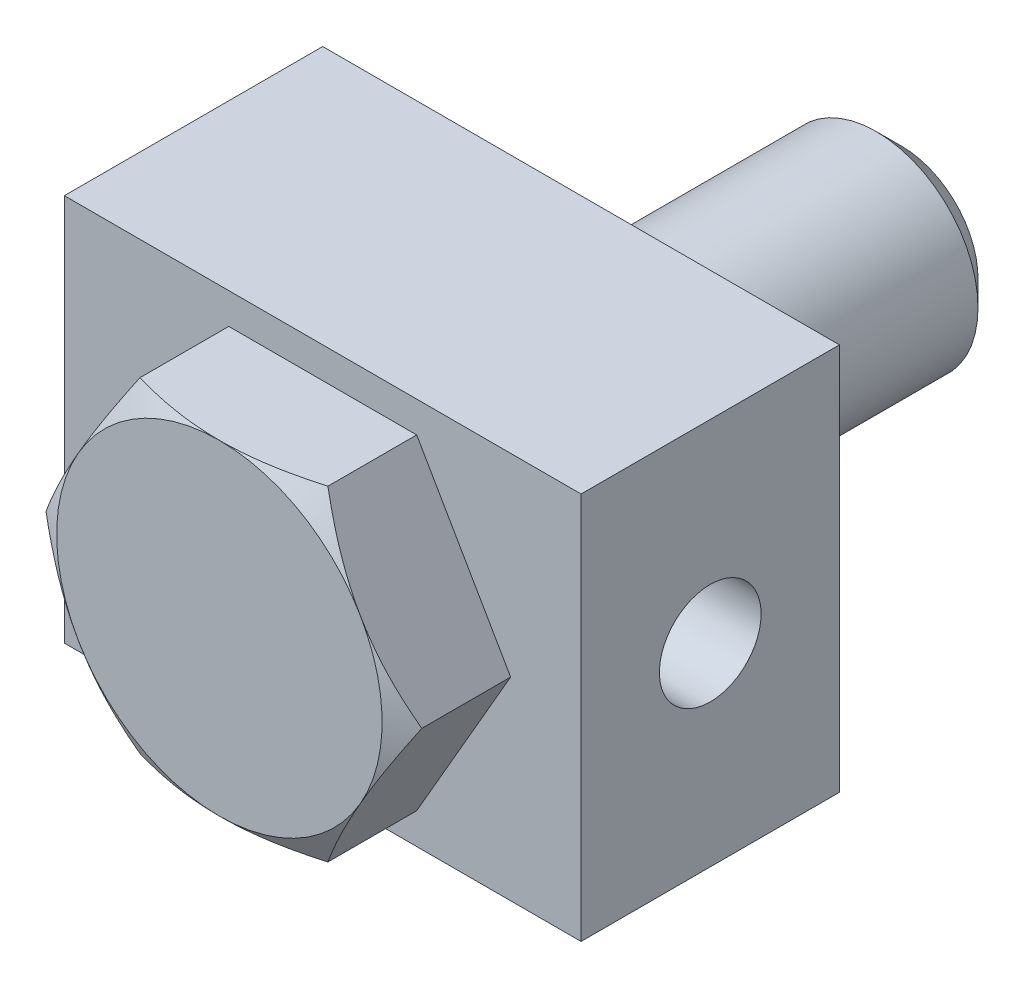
ISO-10303-21;
HEADER;
FILE_DESCRIPTION(('STEP AP214'),'2;1');
FILE_NAME('part.step','',(''),(''),'','','');
FILE_SCHEMA(('AUTOMOTIVE_DESIGN { 1 0 10303 214 1 1 1 1 }'));
ENDSEC;
DATA;
#1=APPLICATION_CONTEXT('core data for automotive mechanical design processes');
#2=APPLICATION_PROTOCOL_DEFINITION('international standard','automotive_design',2000,#1);
#3=PRODUCT_CONTEXT('',#1,'mechanical');
#4=PRODUCT('Part','Part','',(#3));
#5=PRODUCT_RELATED_PRODUCT_CATEGORY('part','',(#4));
#6=PRODUCT_DEFINITION_FORMATION('','',#4);
#7=PRODUCT_DEFINITION_CONTEXT('part definition',#1,'design');
#8=PRODUCT_DEFINITION('design','',#6,#7);
#9=PRODUCT_DEFINITION_SHAPE('','',#8);
#10=(LENGTH_UNIT() NAMED_UNIT(*) SI_UNIT(.MILLI.,.METRE.));
#11=(NAMED_UNIT(*) PLANE_ANGLE_UNIT() SI_UNIT($,.RADIAN.));
#12=(NAMED_UNIT(*) SI_UNIT($,.STERADIAN.) SOLID_ANGLE_UNIT());
#13=UNCERTAINTY_MEASURE_WITH_UNIT(LENGTH_MEASURE(1.E-05),#10,'distance_accuracy_value','');
#14=(GEOMETRIC_REPRESENTATION_CONTEXT(3) GLOBAL_UNCERTAINTY_ASSIGNED_CONTEXT((#13)) GLOBAL_UNIT_ASSIGNED_CONTEXT((#10,
#11,#12)) REPRESENTATION_CONTEXT('',''));
#15=CARTESIAN_POINT('',(0.,0.,0.));
#16=DIRECTION('',(0.,0.,1.));
#17=DIRECTION('',(1.,0.,0.));
#18=AXIS2_PLACEMENT_3D('',#15,#16,#17);
#19=CARTESIAN_POINT('',(9.23760430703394,16.,85.9648074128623));
#20=DIRECTION('',(0.,-1.,0.));
#21=DIRECTION('',(0.,0.,-1.));
#22=AXIS2_PLACEMENT_3D('',#19,#20,#21);
#23=PLANE('',#22);
#24=CARTESIAN_POINT('',(-24.7112843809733,16.,29.3250597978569));
#25=CARTESIAN_POINT('',(-24.3623143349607,16.,29.4941789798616));
#26=CARTESIAN_POINT('',(-24.0129320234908,16.,29.6624470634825));
#27=CARTESIAN_POINT('',(-23.3132567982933,16.,29.9970880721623));
#28=CARTESIAN_POINT('',(-22.9629638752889,16.,30.1634609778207));
#29=CARTESIAN_POINT('',(-21.9104953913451,16.,30.6594919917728));
#30=CARTESIAN_POINT('',(-21.2068349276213,16.,30.9860114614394));
#31=CARTESIAN_POINT('',(-19.7908922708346,16.,31.6304666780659));
#32=CARTESIAN_POINT('',(-19.0785839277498,16.,31.9483451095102));
#33=CARTESIAN_POINT('',(-17.6482667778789,16.,32.5709616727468));
#34=CARTESIAN_POINT('',(-16.9302582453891,16.,32.8757004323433));
#35=CARTESIAN_POINT('',(-15.4645977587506,16.,33.4779257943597));
#36=CARTESIAN_POINT('',(-14.7167256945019,16.,33.7748795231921));
#37=CARTESIAN_POINT('',(-13.2121889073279,16.,34.3460652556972));
#38=CARTESIAN_POINT('',(-12.4555232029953,16.,34.6202946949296));
#39=CARTESIAN_POINT('',(-10.9336699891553,16.,35.1387537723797));
#40=CARTESIAN_POINT('',(-10.1685036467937,16.,35.3830450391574));
#41=CARTESIAN_POINT('',(-8.62712280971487,16.,35.8337346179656));
#42=CARTESIAN_POINT('',(-7.85091191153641,16.,36.0401449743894));
#43=CARTESIAN_POINT('',(-6.68033175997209,16.,36.3132665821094));
#44=CARTESIAN_POINT('',(-6.29015175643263,16.,36.3980454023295));
#45=CARTESIAN_POINT('',(-5.50714502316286,16.,36.5544190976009));
#46=CARTESIAN_POINT('',(-5.11431834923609,16.,36.6260142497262));
#47=CARTESIAN_POINT('',(-4.32630332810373,16.,36.7547495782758));
#48=CARTESIAN_POINT('',(-3.93111505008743,16.,36.811890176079));
#49=CARTESIAN_POINT('',(-3.13878247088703,16.,36.9105762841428));
#50=CARTESIAN_POINT('',(-2.74163817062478,16.,36.9521218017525));
#51=CARTESIAN_POINT('',(-1.95111028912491,16.,37.0182735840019));
#52=CARTESIAN_POINT('',(-1.55774458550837,16.,37.0430921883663));
#53=CARTESIAN_POINT('',(-0.770317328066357,16.,37.0760791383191));
#54=CARTESIAN_POINT('',(-0.376255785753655,16.,37.0842477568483));
#55=CARTESIAN_POINT('',(0.411861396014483,16.,37.0837408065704));
#56=CARTESIAN_POINT('',(0.805917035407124,16.,37.0750651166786));
#57=CARTESIAN_POINT('',(1.59331426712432,16.,37.041079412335));
#58=CARTESIAN_POINT('',(1.98665582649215,16.,37.0157686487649));
#59=CARTESIAN_POINT('',(2.93511162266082,16.,36.9352139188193));
#60=CARTESIAN_POINT('',(3.48955254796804,16.,36.8719032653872));
#61=CARTESIAN_POINT('',(4.59425504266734,16.,36.7157029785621));
#62=CARTESIAN_POINT('',(5.14451602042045,16.,36.6228092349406));
#63=CARTESIAN_POINT('',(6.24035690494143,16.,36.4107475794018));
#64=CARTESIAN_POINT('',(6.78593274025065,16.,36.291558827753));
#65=CARTESIAN_POINT('',(7.87158005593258,16.,36.0305385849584));
#66=CARTESIAN_POINT('',(8.41165162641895,16.,35.8887074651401));
#67=CARTESIAN_POINT('',(9.49806397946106,16.,35.5825243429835));
#68=CARTESIAN_POINT('',(10.0442844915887,16.,35.4177485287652));
#69=CARTESIAN_POINT('',(11.1313437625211,16.,35.0713992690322));
#70=CARTESIAN_POINT('',(11.6721824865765,16.,34.8898257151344));
#71=CARTESIAN_POINT('',(12.7487490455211,16.,34.5127439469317));
#72=CARTESIAN_POINT('',(13.2844785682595,16.,34.3172405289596));
#73=CARTESIAN_POINT('',(14.3515141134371,16.,33.9145766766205));
#74=CARTESIAN_POINT('',(14.8828201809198,16.,33.707416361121));
#75=CARTESIAN_POINT('',(16.1081198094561,16.,33.2166436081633));
#76=CARTESIAN_POINT('',(16.8006919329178,16.,32.9294882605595));
#77=CARTESIAN_POINT('',(18.1801678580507,16.,32.3418336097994));
#78=CARTESIAN_POINT('',(18.8670713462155,16.,32.0413335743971));
#79=CARTESIAN_POINT('',(20.236227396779,16.,31.429582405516));
#80=CARTESIAN_POINT('',(20.9184789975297,16.,31.1183291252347));
#81=CARTESIAN_POINT('',(22.278945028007,16.,30.4871742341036));
#82=CARTESIAN_POINT('',(22.9571595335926,16.,30.1672727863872));
#83=CARTESIAN_POINT('',(24.3108853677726,16.,29.5200659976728));
#84=CARTESIAN_POINT('',(24.9863932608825,16.,29.19275348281));
#85=CARTESIAN_POINT('',(26.3345399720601,16.,28.532273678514));
#86=CARTESIAN_POINT('',(27.0071787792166,16.,28.1991063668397));
#87=CARTESIAN_POINT('',(28.3499383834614,16.,27.5279340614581));
#88=CARTESIAN_POINT('',(29.020059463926,16.,27.1899296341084));
#89=CARTESIAN_POINT('',(30.3582169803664,16.,26.5098169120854));
#90=CARTESIAN_POINT('',(31.0262534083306,16.,26.1677086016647));
#91=CARTESIAN_POINT('',(32.920418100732,16.,25.1914747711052));
#92=CARTESIAN_POINT('',(34.144420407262,16.,24.5532242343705));
#93=CARTESIAN_POINT('',(36.5878340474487,16.,23.2679220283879));
#94=CARTESIAN_POINT('',(37.8072452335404,16.,22.6208700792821));
#95=CARTESIAN_POINT('',(40.2396073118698,16.,21.3215131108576));
#96=CARTESIAN_POINT('',(41.4525666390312,16.,20.6692238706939));
#97=CARTESIAN_POINT('',(43.2698250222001,16.,19.6868354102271));
#98=CARTESIAN_POINT('',(43.8751991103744,16.,19.3587218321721));
#99=CARTESIAN_POINT('',(45.0853008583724,16.,18.7013069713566));
#100=CARTESIAN_POINT('',(45.6900285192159,16.,18.3720056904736));
#101=CARTESIAN_POINT('',(46.2944690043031,16.,18.0421779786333));
#102=B_SPLINE_CURVE_WITH_KNOTS('',3,(#24,#25,#26,#27,#28,#29,#30,#31,#32,#33,#34,#35,#36,#37,
#38,#39,#40,#41,#42,#43,#44,#45,#46,#47,#48,#49,#50,#51,#52,#53,#54,#55,#56,#57,#58,#59,#60,#61,
#62,#63,#64,#65,#66,#67,#68,#69,#70,#71,#72,#73,#74,#75,#76,#77,#78,#79,#80,#81,#82,#83,#84,#85,
#86,#87,#88,#89,#90,#91,#92,#93,#94,#95,#96,#97,#98,#99,#100,#101),.UNSPECIFIED.,.F.,.F.,(4,2,2,
2,2,2,2,2,2,2,2,2,2,2,2,2,2,2,2,2,2,2,2,2,2,2,2,2,2,2,2,2,2,2,2,2,2,2,4),(0.,1.16336904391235,
2.32674998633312,4.65386145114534,6.99381555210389,9.33365772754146,11.7473864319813,
14.1613871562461,16.570332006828,18.9785095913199,20.1761755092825,21.3738162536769,
22.5714220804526,23.7690273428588,24.9511278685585,26.1332090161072,27.3152986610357,
28.4974415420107,30.1706449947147,31.8440810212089,33.5188481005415,35.1935877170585,
36.9048633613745,38.6161500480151,40.3268503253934,42.0375331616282,44.286575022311,
46.5357404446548,48.7853575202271,51.0349321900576,53.286786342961,55.53864905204,
57.7902502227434,60.0418600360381,64.1830509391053,68.3243738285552,72.4560340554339,
74.5217597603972,76.5874822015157),.UNSPECIFIED.);
#103=CARTESIAN_POINT('',(9.23760430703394,16.,35.6549376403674));
#104=VERTEX_POINT('',#103);
#105=CARTESIAN_POINT('',(0.,16.,37.084));
#106=VERTEX_POINT('',#105);
#107=EDGE_CURVE('E109',#104,#106,#102,.F.);
#108=ORIENTED_EDGE('',*,*,#107,.F.);
#109=DIRECTION('',(0.,0.,-1.));
#110=VECTOR('',#109,1.);
#111=CARTESIAN_POINT('',(9.23760430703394,16.,85.9648074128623));
#112=LINE('',#111,#110);
#113=CARTESIAN_POINT('',(9.23760430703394,16.,26.924));
#114=VERTEX_POINT('',#113);
#115=EDGE_CURVE('E208',#104,#114,#112,.T.);
#116=ORIENTED_EDGE('',*,*,#115,.T.);
#117=DIRECTION('',(-1.,0.,0.));
#118=VECTOR('',#117,1.);
#119=CARTESIAN_POINT('',(9.23760430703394,16.,26.924));
#120=LINE('',#119,#118);
#121=CARTESIAN_POINT('',(-9.237604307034,16.,26.924));
#122=VERTEX_POINT('',#121);
#123=EDGE_CURVE('E205',#114,#122,#120,.T.);
#124=ORIENTED_EDGE('',*,*,#123,.T.);
#125=DIRECTION('',(0.,0.,-1.));
#126=VECTOR('',#125,1.);
#127=CARTESIAN_POINT('',(-9.23760430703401,16.,85.9648074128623));
#128=LINE('',#127,#126);
#129=CARTESIAN_POINT('',(-9.23760430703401,16.,35.6549376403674));
#130=VERTEX_POINT('',#129);
#131=EDGE_CURVE('E142',#130,#122,#128,.T.);
#132=ORIENTED_EDGE('',*,*,#131,.F.);
#133=EDGE_CURVE('E121',#106,#130,#102,.F.);
#134=ORIENTED_EDGE('',*,*,#133,.F.);
#135=EDGE_LOOP('',(#108,#116,#124,#132,#134));
#136=FACE_BOUND('',#135,.T.);
#137=ADVANCED_FACE('F14',(#136),#23,.F.);
#138=CARTESIAN_POINT('',(18.475208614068,0.,85.9648074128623));
#139=DIRECTION('',(-0.866025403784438,-0.5,0.));
#140=DIRECTION('',(0.5,-0.866025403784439,0.));
#141=AXIS2_PLACEMENT_3D('',#138,#139,#140);
#142=PLANE('',#141);
#143=CARTESIAN_POINT('',(18.4753240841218,-0.000200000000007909,35.6548709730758));
#144=CARTESIAN_POINT('',(18.2722852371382,0.351473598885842,35.7720876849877));
#145=CARTESIAN_POINT('',(18.0684544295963,0.704518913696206,35.8839853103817));
#146=CARTESIAN_POINT('',(17.6591583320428,1.41344054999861,36.0956638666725));
#147=CARTESIAN_POINT('',(17.4536925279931,1.76931776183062,36.1954408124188));
#148=CARTESIAN_POINT('',(17.0407293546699,2.48459095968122,36.3815367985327));
#149=CARTESIAN_POINT('',(16.8332283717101,2.84399320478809,36.4678239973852));
#150=CARTESIAN_POINT('',(16.416784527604,3.56529510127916,36.62508765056));
#151=CARTESIAN_POINT('',(16.2078417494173,3.92719460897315,36.6960649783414));
#152=CARTESIAN_POINT('',(15.793868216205,4.64421780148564,36.8196899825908));
#153=CARTESIAN_POINT('',(15.588868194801,4.99928825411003,36.8727468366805));
#154=CARTESIAN_POINT('',(15.1779288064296,5.71105615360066,36.9617113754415));
#155=CARTESIAN_POINT('',(14.9719894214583,6.06775363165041,36.9976187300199));
#156=CARTESIAN_POINT('',(14.5597647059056,6.78174778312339,37.0513776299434));
#157=CARTESIAN_POINT('',(14.3534800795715,7.13904323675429,37.0692506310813));
#158=CARTESIAN_POINT('',(13.9407204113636,7.85396395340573,37.0865564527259));
#159=CARTESIAN_POINT('',(13.7342453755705,8.21158920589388,37.0859898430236));
#160=CARTESIAN_POINT('',(13.3482423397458,8.88016607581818,37.0677045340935));
#161=CARTESIAN_POINT('',(13.1686868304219,9.19116534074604,37.0522162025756));
#162=CARTESIAN_POINT('',(12.809988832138,9.81244849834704,37.0075864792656));
#163=CARTESIAN_POINT('',(12.6308463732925,10.1227323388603,36.9784441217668));
#164=CARTESIAN_POINT('',(12.273071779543,10.7424161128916,36.9070144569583));
#165=CARTESIAN_POINT('',(12.0944401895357,11.0518151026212,36.8647162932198));
#166=CARTESIAN_POINT('',(11.7380144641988,11.6691625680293,36.7677171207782));
#167=CARTESIAN_POINT('',(11.5602203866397,11.9771109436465,36.7130152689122));
#168=CARTESIAN_POINT('',(11.0205166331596,12.9119052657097,36.5289213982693));
#169=CARTESIAN_POINT('',(10.6601698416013,13.5360442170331,36.3811733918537));
#170=CARTESIAN_POINT('',(9.94484943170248,14.7750155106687,36.0458459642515));
#171=CARTESIAN_POINT('',(9.58986665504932,15.3898637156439,35.8583452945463));
#172=CARTESIAN_POINT('',(9.2374888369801,16.0002,35.6548709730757));
#173=B_SPLINE_CURVE_WITH_KNOTS('',3,(#143,#144,#145,#146,#147,#148,#149,#150,#151,#152,#153,
#154,#155,#156,#157,#158,#159,#160,#161,#162,#163,#164,#165,#166,#167,#168,#169,#170,#171,#172),
.UNSPECIFIED.,.F.,.F.,(4,2,2,2,2,2,2,2,2,2,2,2,2,2,4),(0.,1.26800386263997,2.53642350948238,
3.80779337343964,5.07909068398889,6.31900943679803,7.55895205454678,8.79741774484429,
10.0358451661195,11.1139198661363,12.1920708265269,13.2711138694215,14.350230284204,
16.5559177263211,18.7572757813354),.UNSPECIFIED.);
#174=CARTESIAN_POINT('',(18.475208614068,0.,35.6549376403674));
#175=VERTEX_POINT('',#174);
#176=CARTESIAN_POINT('',(13.856406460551,8.,37.084));
#177=VERTEX_POINT('',#176);
#178=EDGE_CURVE('E29',#175,#177,#173,.T.);
#179=ORIENTED_EDGE('',*,*,#178,.F.);
#180=DIRECTION('',(0.,0.,-1.));
#181=VECTOR('',#180,1.);
#182=CARTESIAN_POINT('',(18.475208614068,0.,85.9648074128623));
#183=LINE('',#182,#181);
#184=CARTESIAN_POINT('',(18.475208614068,0.,26.924));
#185=VERTEX_POINT('',#184);
#186=EDGE_CURVE('E210',#175,#185,#183,.T.);
#187=ORIENTED_EDGE('',*,*,#186,.T.);
#188=DIRECTION('',(-0.5,0.866025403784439,0.));
#189=VECTOR('',#188,1.);
#190=CARTESIAN_POINT('',(18.475208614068,0.,26.924));
#191=LINE('',#190,#189);
#192=EDGE_CURVE('E202',#185,#114,#191,.T.);
#193=ORIENTED_EDGE('',*,*,#192,.T.);
#194=ORIENTED_EDGE('',*,*,#115,.F.);
#195=EDGE_CURVE('E116',#177,#104,#173,.T.);
#196=ORIENTED_EDGE('',*,*,#195,.F.);
#197=EDGE_LOOP('',(#179,#187,#193,#194,#196));
#198=FACE_BOUND('',#197,.T.);
#199=ADVANCED_FACE('F171',(#198),#142,.F.);
#200=CARTESIAN_POINT('',(9.23760430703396,-16.,85.9648074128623));
#201=DIRECTION('',(-0.866025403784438,0.5,0.));
#202=DIRECTION('',(-0.5,-0.866025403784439,0.));
#203=AXIS2_PLACEMENT_3D('',#200,#201,#202);
#204=PLANE('',#203);
#205=CARTESIAN_POINT('',(9.23748883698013,-16.0002,35.6548709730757));
#206=CARTESIAN_POINT('',(9.44052768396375,-15.6485264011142,35.7720876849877));
#207=CARTESIAN_POINT('',(9.64435849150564,-15.2954810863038,35.8839853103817));
#208=CARTESIAN_POINT('',(10.0536545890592,-14.5865594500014,36.0956638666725));
#209=CARTESIAN_POINT('',(10.2591203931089,-14.2306822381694,36.1954408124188));
#210=CARTESIAN_POINT('',(10.672083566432,-13.5154090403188,36.3815367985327));
#211=CARTESIAN_POINT('',(10.8795845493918,-13.1560067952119,36.4678239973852));
#212=CARTESIAN_POINT('',(11.2960283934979,-12.4347048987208,36.62508765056));
#213=CARTESIAN_POINT('',(11.5049711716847,-12.0728053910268,36.6960649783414));
#214=CARTESIAN_POINT('',(11.9189447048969,-11.3557821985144,36.8196899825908));
#215=CARTESIAN_POINT('',(12.1239447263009,-11.00071174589,36.8727468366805));
#216=CARTESIAN_POINT('',(12.5348841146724,-10.2889438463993,36.9617113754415));
#217=CARTESIAN_POINT('',(12.7408234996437,-9.93224636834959,36.9976187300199));
#218=CARTESIAN_POINT('',(13.1530482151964,-9.21825221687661,37.0513776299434));
#219=CARTESIAN_POINT('',(13.3593328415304,-8.86095676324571,37.0692506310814));
#220=CARTESIAN_POINT('',(13.7720925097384,-8.14603604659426,37.0865564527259));
#221=CARTESIAN_POINT('',(13.9785675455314,-7.78841079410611,37.0859898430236));
#222=CARTESIAN_POINT('',(14.3645705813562,-7.11983392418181,37.0677045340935));
#223=CARTESIAN_POINT('',(14.5441260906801,-6.80883465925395,37.0522162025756));
#224=CARTESIAN_POINT('',(14.902824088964,-6.18755150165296,37.0075864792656));
#225=CARTESIAN_POINT('',(15.0819665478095,-5.87726766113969,36.9784441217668));
#226=CARTESIAN_POINT('',(15.4397411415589,-5.25758388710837,36.9070144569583));
#227=CARTESIAN_POINT('',(15.6183727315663,-4.94818489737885,36.8647162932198));
#228=CARTESIAN_POINT('',(15.9747984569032,-4.33083743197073,36.7677171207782));
#229=CARTESIAN_POINT('',(16.1525925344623,-4.02288905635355,36.7130152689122));
#230=CARTESIAN_POINT('',(16.6922962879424,-3.08809473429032,36.5289213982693));
#231=CARTESIAN_POINT('',(17.0526430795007,-2.46395578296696,36.3811733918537));
#232=CARTESIAN_POINT('',(17.7679634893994,-1.22498448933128,36.0458459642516));
#233=CARTESIAN_POINT('',(18.1229462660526,-0.610136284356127,35.8583452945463));
#234=CARTESIAN_POINT('',(18.4753240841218,0.000199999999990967,35.6548709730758));
#235=B_SPLINE_CURVE_WITH_KNOTS('',3,(#205,#206,#207,#208,#209,#210,#211,#212,#213,#214,#215,
#216,#217,#218,#219,#220,#221,#222,#223,#224,#225,#226,#227,#228,#229,#230,#231,#232,#233,#234),
.UNSPECIFIED.,.F.,.F.,(4,2,2,2,2,2,2,2,2,2,2,2,2,2,4),(0.,1.26800386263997,2.53642350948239,
3.80779337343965,5.0790906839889,6.31900943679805,7.5589520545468,8.79741774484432,
10.0358451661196,11.1139198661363,12.1920708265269,13.2711138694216,14.350230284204,
16.5559177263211,18.7572757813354),.UNSPECIFIED.);
#236=CARTESIAN_POINT('',(9.23760430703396,-16.,35.6549376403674));
#237=VERTEX_POINT('',#236);
#238=CARTESIAN_POINT('',(13.856406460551,-8.,37.084));
#239=VERTEX_POINT('',#238);
#240=EDGE_CURVE('E37',#237,#239,#235,.T.);
#241=ORIENTED_EDGE('',*,*,#240,.F.);
#242=DIRECTION('',(0.,0.,-1.));
#243=VECTOR('',#242,1.);
#244=CARTESIAN_POINT('',(9.23760430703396,-16.,85.9648074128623));
#245=LINE('',#244,#243);
#246=CARTESIAN_POINT('',(9.23760430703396,-16.,26.924));
#247=VERTEX_POINT('',#246);
#248=EDGE_CURVE('E212',#237,#247,#245,.T.);
#249=ORIENTED_EDGE('',*,*,#248,.T.);
#250=DIRECTION('',(0.5,0.866025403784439,0.));
#251=VECTOR('',#250,1.);
#252=CARTESIAN_POINT('',(9.23760430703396,-16.,26.924));
#253=LINE('',#252,#251);
#254=EDGE_CURVE('E199',#247,#185,#253,.T.);
#255=ORIENTED_EDGE('',*,*,#254,.T.);
#256=ORIENTED_EDGE('',*,*,#186,.F.);
#257=EDGE_CURVE('E183',#239,#175,#235,.T.);
#258=ORIENTED_EDGE('',*,*,#257,.F.);
#259=EDGE_LOOP('',(#241,#249,#255,#256,#258));
#260=FACE_BOUND('',#259,.T.);
#261=ADVANCED_FACE('F175',(#260),#204,.F.);
#262=CARTESIAN_POINT('',(-9.23760430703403,-16.,85.9648074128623));
#263=DIRECTION('',(0.,1.,0.));
#264=DIRECTION('',(0.,0.,1.));
#265=AXIS2_PLACEMENT_3D('',#262,#263,#264);
#266=PLANE('',#265);
#267=CARTESIAN_POINT('',(-24.7112843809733,-16.,29.3250597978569));
#268=CARTESIAN_POINT('',(-24.3623143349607,-16.,29.4941789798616));
#269=CARTESIAN_POINT('',(-24.0129320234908,-16.,29.6624470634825));
#270=CARTESIAN_POINT('',(-23.3132567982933,-16.,29.9970880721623));
#271=CARTESIAN_POINT('',(-22.962963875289,-16.,30.1634609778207));
#272=CARTESIAN_POINT('',(-21.9104953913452,-16.,30.6594919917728));
#273=CARTESIAN_POINT('',(-21.2068349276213,-16.,30.9860114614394));
#274=CARTESIAN_POINT('',(-19.7908922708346,-16.,31.6304666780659));
#275=CARTESIAN_POINT('',(-19.0785839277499,-16.,31.9483451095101));
#276=CARTESIAN_POINT('',(-17.648266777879,-16.,32.5709616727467));
#277=CARTESIAN_POINT('',(-16.9302582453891,-16.,32.8757004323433));
#278=CARTESIAN_POINT('',(-15.4645977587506,-16.,33.4779257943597));
#279=CARTESIAN_POINT('',(-14.716725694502,-16.,33.7748795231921));
#280=CARTESIAN_POINT('',(-13.212188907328,-16.,34.3460652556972));
#281=CARTESIAN_POINT('',(-12.4555232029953,-16.,34.6202946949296));
#282=CARTESIAN_POINT('',(-10.9336699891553,-16.,35.1387537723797));
#283=CARTESIAN_POINT('',(-10.1685036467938,-16.,35.3830450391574));
#284=CARTESIAN_POINT('',(-8.6271228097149,-16.,35.8337346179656));
#285=CARTESIAN_POINT('',(-7.85091191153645,-16.,36.0401449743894));
#286=CARTESIAN_POINT('',(-6.68033175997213,-16.,36.3132665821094));
#287=CARTESIAN_POINT('',(-6.29015175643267,-16.,36.3980454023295));
#288=CARTESIAN_POINT('',(-5.5071450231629,-16.,36.5544190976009));
#289=CARTESIAN_POINT('',(-5.11431834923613,-16.,36.6260142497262));
#290=CARTESIAN_POINT('',(-4.32630332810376,-16.,36.7547495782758));
#291=CARTESIAN_POINT('',(-3.93111505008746,-16.,36.811890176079));
#292=CARTESIAN_POINT('',(-3.13878247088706,-16.,36.9105762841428));
#293=CARTESIAN_POINT('',(-2.74163817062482,-16.,36.9521218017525));
#294=CARTESIAN_POINT('',(-1.95111028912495,-16.,37.0182735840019));
#295=CARTESIAN_POINT('',(-1.5577445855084,-16.,37.0430921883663));
#296=CARTESIAN_POINT('',(-0.770317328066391,-16.,37.0760791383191));
#297=CARTESIAN_POINT('',(-0.376255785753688,-16.,37.0842477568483));
#298=CARTESIAN_POINT('',(0.411861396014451,-16.,37.0837408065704));
#299=CARTESIAN_POINT('',(0.805917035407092,-16.,37.0750651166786));
#300=CARTESIAN_POINT('',(1.59331426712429,-16.,37.041079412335));
#301=CARTESIAN_POINT('',(1.98665582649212,-16.,37.0157686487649));
#302=CARTESIAN_POINT('',(2.93511162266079,-16.,36.9352139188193));
#303=CARTESIAN_POINT('',(3.48955254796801,-16.,36.8719032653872));
#304=CARTESIAN_POINT('',(4.59425504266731,-16.,36.7157029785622));
#305=CARTESIAN_POINT('',(5.14451602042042,-16.,36.6228092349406));
#306=CARTESIAN_POINT('',(6.2403569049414,-16.,36.4107475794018));
#307=CARTESIAN_POINT('',(6.78593274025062,-16.,36.291558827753));
#308=CARTESIAN_POINT('',(7.87158005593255,-16.,36.0305385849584));
#309=CARTESIAN_POINT('',(8.41165162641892,-16.,35.8887074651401));
#310=CARTESIAN_POINT('',(9.49806397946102,-16.,35.5825243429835));
#311=CARTESIAN_POINT('',(10.0442844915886,-16.,35.4177485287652));
#312=CARTESIAN_POINT('',(11.1313437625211,-16.,35.0713992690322));
#313=CARTESIAN_POINT('',(11.6721824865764,-16.,34.8898257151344));
#314=CARTESIAN_POINT('',(12.7487490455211,-16.,34.5127439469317));
#315=CARTESIAN_POINT('',(13.2844785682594,-16.,34.3172405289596));
#316=CARTESIAN_POINT('',(14.3515141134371,-16.,33.9145766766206));
#317=CARTESIAN_POINT('',(14.8828201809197,-16.,33.707416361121));
#318=CARTESIAN_POINT('',(16.108119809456,-16.,33.2166436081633));
#319=CARTESIAN_POINT('',(16.8006919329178,-16.,32.9294882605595));
#320=CARTESIAN_POINT('',(18.1801678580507,-16.,32.3418336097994));
#321=CARTESIAN_POINT('',(18.8670713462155,-16.,32.0413335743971));
#322=CARTESIAN_POINT('',(20.2362273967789,-16.,31.429582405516));
#323=CARTESIAN_POINT('',(20.9184789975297,-16.,31.1183291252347));
#324=CARTESIAN_POINT('',(22.278945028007,-16.,30.4871742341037));
#325=CARTESIAN_POINT('',(22.9571595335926,-16.,30.1672727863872));
#326=CARTESIAN_POINT('',(24.3108853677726,-16.,29.5200659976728));
#327=CARTESIAN_POINT('',(24.9863932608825,-16.,29.19275348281));
#328=CARTESIAN_POINT('',(26.3345399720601,-16.,28.532273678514));
#329=CARTESIAN_POINT('',(27.0071787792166,-16.,28.1991063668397));
#330=CARTESIAN_POINT('',(28.3499383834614,-16.,27.5279340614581));
#331=CARTESIAN_POINT('',(29.020059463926,-16.,27.1899296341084));
#332=CARTESIAN_POINT('',(30.3582169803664,-16.,26.5098169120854));
#333=CARTESIAN_POINT('',(31.0262534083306,-16.,26.1677086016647));
#334=CARTESIAN_POINT('',(32.920418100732,-16.,25.1914747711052));
#335=CARTESIAN_POINT('',(34.144420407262,-16.,24.5532242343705));
#336=CARTESIAN_POINT('',(36.5878340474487,-16.,23.2679220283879));
#337=CARTESIAN_POINT('',(37.8072452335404,-16.,22.6208700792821));
#338=CARTESIAN_POINT('',(40.2396073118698,-16.,21.3215131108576));
#339=CARTESIAN_POINT('',(41.4525666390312,-16.,20.6692238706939));
#340=CARTESIAN_POINT('',(43.2698250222,-16.,19.6868354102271));
#341=CARTESIAN_POINT('',(43.8751991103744,-16.,19.3587218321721));
#342=CARTESIAN_POINT('',(45.0853008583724,-16.,18.7013069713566));
#343=CARTESIAN_POINT('',(45.6900285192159,-16.,18.3720056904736));
#344=CARTESIAN_POINT('',(46.2944690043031,-16.,18.0421779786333));
#345=B_SPLINE_CURVE_WITH_KNOTS('',3,(#267,#268,#269,#270,#271,#272,#273,#274,#275,#276,#277,
#278,#279,#280,#281,#282,#283,#284,#285,#286,#287,#288,#289,#290,#291,#292,#293,#294,#295,#296,
#297,#298,#299,#300,#301,#302,#303,#304,#305,#306,#307,#308,#309,#310,#311,#312,#313,#314,#315,
#316,#317,#318,#319,#320,#321,#322,#323,#324,#325,#326,#327,#328,#329,#330,#331,#332,#333,#334,
#335,#336,#337,#338,#339,#340,#341,#342,#343,#344),.UNSPECIFIED.,.F.,.F.,(4,2,2,2,2,2,2,2,2,2,2,
2,2,2,2,2,2,2,2,2,2,2,2,2,2,2,2,2,2,2,2,2,2,2,2,2,2,2,4),(0.,1.16336904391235,2.32674998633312,
4.65386145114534,6.99381555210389,9.33365772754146,11.7473864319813,14.1613871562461,
16.570332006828,18.9785095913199,20.1761755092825,21.3738162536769,22.5714220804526,
23.7690273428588,24.9511278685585,26.1332090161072,27.3152986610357,28.4974415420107,
30.1706449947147,31.844081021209,33.5188481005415,35.1935877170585,36.9048633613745,
38.616150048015,40.3268503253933,42.0375331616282,44.286575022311,46.5357404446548,
48.7853575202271,51.0349321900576,53.286786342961,55.53864905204,57.7902502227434,
60.0418600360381,64.1830509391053,68.3243738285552,72.4560340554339,74.5217597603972,
76.5874822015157),.UNSPECIFIED.);
#346=CARTESIAN_POINT('',(-9.23760430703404,-16.,35.6549376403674));
#347=VERTEX_POINT('',#346);
#348=CARTESIAN_POINT('',(0.,-16.,37.084));
#349=VERTEX_POINT('',#348);
#350=EDGE_CURVE('E158',#347,#349,#345,.T.);
#351=ORIENTED_EDGE('',*,*,#350,.F.);
#352=DIRECTION('',(0.,0.,-1.));
#353=VECTOR('',#352,1.);
#354=CARTESIAN_POINT('',(-9.23760430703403,-16.,85.9648074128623));
#355=LINE('',#354,#353);
#356=CARTESIAN_POINT('',(-9.23760430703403,-16.,26.924));
#357=VERTEX_POINT('',#356);
#358=EDGE_CURVE('E214',#347,#357,#355,.T.);
#359=ORIENTED_EDGE('',*,*,#358,.T.);
#360=DIRECTION('',(1.,0.,0.));
#361=VECTOR('',#360,1.);
#362=CARTESIAN_POINT('',(-9.23760430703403,-16.,26.924));
#363=LINE('',#362,#361);
#364=EDGE_CURVE('E196',#357,#247,#363,.T.);
#365=ORIENTED_EDGE('',*,*,#364,.T.);
#366=ORIENTED_EDGE('',*,*,#248,.F.);
#367=EDGE_CURVE('E189',#349,#237,#345,.T.);
#368=ORIENTED_EDGE('',*,*,#367,.F.);
#369=EDGE_LOOP('',(#351,#359,#365,#366,#368));
#370=FACE_BOUND('',#369,.T.);
#371=ADVANCED_FACE('F355',(#370),#266,.F.);
#372=CARTESIAN_POINT('',(-18.475208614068,0.,85.9648074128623));
#373=DIRECTION('',(0.866025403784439,0.5,0.));
#374=DIRECTION('',(-0.5,0.866025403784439,0.));
#375=AXIS2_PLACEMENT_3D('',#372,#373,#374);
#376=PLANE('',#375);
#377=CARTESIAN_POINT('',(-18.4753240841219,0.000199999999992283,35.6548709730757));
#378=CARTESIAN_POINT('',(-18.2722852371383,-0.351473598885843,35.7720876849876));
#379=CARTESIAN_POINT('',(-18.0684544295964,-0.704518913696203,35.8839853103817));
#380=CARTESIAN_POINT('',(-17.6591583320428,-1.41344054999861,36.0956638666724));
#381=CARTESIAN_POINT('',(-17.4536925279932,-1.76931776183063,36.1954408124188));
#382=CARTESIAN_POINT('',(-17.04072935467,-2.48459095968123,36.3815367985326));
#383=CARTESIAN_POINT('',(-16.8332283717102,-2.8439932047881,36.4678239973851));
#384=CARTESIAN_POINT('',(-16.4167845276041,-3.56529510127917,36.62508765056));
#385=CARTESIAN_POINT('',(-16.2078417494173,-3.92719460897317,36.6960649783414));
#386=CARTESIAN_POINT('',(-15.7938682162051,-4.64421780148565,36.8196899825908));
#387=CARTESIAN_POINT('',(-15.5888681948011,-4.99928825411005,36.8727468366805));
#388=CARTESIAN_POINT('',(-15.1779288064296,-5.71105615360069,36.9617113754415));
#389=CARTESIAN_POINT('',(-14.9719894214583,-6.06775363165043,36.9976187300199));
#390=CARTESIAN_POINT('',(-14.5597647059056,-6.78174778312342,37.0513776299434));
#391=CARTESIAN_POINT('',(-14.3534800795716,-7.13904323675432,37.0692506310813));
#392=CARTESIAN_POINT('',(-13.9407204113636,-7.85396395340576,37.0865564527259));
#393=CARTESIAN_POINT('',(-13.7342453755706,-8.21158920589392,37.0859898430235));
#394=CARTESIAN_POINT('',(-13.3482423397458,-8.88016607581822,37.0677045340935));
#395=CARTESIAN_POINT('',(-13.1686868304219,-9.19116534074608,37.0522162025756));
#396=CARTESIAN_POINT('',(-12.809988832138,-9.81244849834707,37.0075864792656));
#397=CARTESIAN_POINT('',(-12.6308463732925,-10.1227323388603,36.9784441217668));
#398=CARTESIAN_POINT('',(-12.2730717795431,-10.7424161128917,36.9070144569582));
#399=CARTESIAN_POINT('',(-12.0944401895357,-11.0518151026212,36.8647162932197));
#400=CARTESIAN_POINT('',(-11.7380144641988,-11.6691625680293,36.7677171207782));
#401=CARTESIAN_POINT('',(-11.5602203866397,-11.9771109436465,36.7130152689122));
#402=CARTESIAN_POINT('',(-11.0205166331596,-12.9119052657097,36.5289213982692));
#403=CARTESIAN_POINT('',(-10.6601698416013,-13.5360442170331,36.3811733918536));
#404=CARTESIAN_POINT('',(-9.94484943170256,-14.7750155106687,36.0458459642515));
#405=CARTESIAN_POINT('',(-9.5898666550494,-15.3898637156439,35.8583452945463));
#406=CARTESIAN_POINT('',(-9.2374888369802,-16.0002,35.6548709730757));
#407=B_SPLINE_CURVE_WITH_KNOTS('',3,(#377,#378,#379,#380,#381,#382,#383,#384,#385,#386,#387,
#388,#389,#390,#391,#392,#393,#394,#395,#396,#397,#398,#399,#400,#401,#402,#403,#404,#405,#406),
.UNSPECIFIED.,.F.,.F.,(4,2,2,2,2,2,2,2,2,2,2,2,2,2,4),(0.,1.26800386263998,2.5364235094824,
3.80779337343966,5.07909068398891,6.31900943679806,7.55895205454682,8.79741774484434,
10.0358451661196,11.1139198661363,12.1920708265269,13.2711138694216,14.3502302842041,
16.5559177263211,18.7572757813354),.UNSPECIFIED.);
#408=CARTESIAN_POINT('',(-18.475208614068,0.,35.6549376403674));
#409=VERTEX_POINT('',#408);
#410=CARTESIAN_POINT('',(-13.856406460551,-8.,37.084));
#411=VERTEX_POINT('',#410);
#412=EDGE_CURVE('E143',#409,#411,#407,.T.);
#413=ORIENTED_EDGE('',*,*,#412,.F.);
#414=DIRECTION('',(0.,0.,-1.));
#415=VECTOR('',#414,1.);
#416=CARTESIAN_POINT('',(-18.475208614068,0.,85.9648074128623));
#417=LINE('',#416,#415);
#418=CARTESIAN_POINT('',(-18.475208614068,0.,26.924));
#419=VERTEX_POINT('',#418);
#420=EDGE_CURVE('E216',#409,#419,#417,.T.);
#421=ORIENTED_EDGE('',*,*,#420,.T.);
#422=DIRECTION('',(0.5,-0.866025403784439,0.));
#423=VECTOR('',#422,1.);
#424=CARTESIAN_POINT('',(-18.475208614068,0.,26.924));
#425=LINE('',#424,#423);
#426=EDGE_CURVE('E193',#419,#357,#425,.T.);
#427=ORIENTED_EDGE('',*,*,#426,.T.);
#428=ORIENTED_EDGE('',*,*,#358,.F.);
#429=EDGE_CURVE('E120',#411,#347,#407,.T.);
#430=ORIENTED_EDGE('',*,*,#429,.F.);
#431=EDGE_LOOP('',(#413,#421,#427,#428,#430));
#432=FACE_BOUND('',#431,.T.);
#433=ADVANCED_FACE('F360',(#432),#376,.F.);
#434=CARTESIAN_POINT('',(-9.23760430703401,16.,85.9648074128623));
#435=DIRECTION('',(0.866025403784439,-0.5,0.));
#436=DIRECTION('',(0.5,0.866025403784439,0.));
#437=AXIS2_PLACEMENT_3D('',#434,#435,#436);
#438=PLANE('',#437);
#439=CARTESIAN_POINT('',(-9.23748883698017,16.0002,35.6548709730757));
#440=CARTESIAN_POINT('',(-9.44052768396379,15.6485264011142,35.7720876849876));
#441=CARTESIAN_POINT('',(-9.64435849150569,15.2954810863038,35.8839853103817));
#442=CARTESIAN_POINT('',(-10.0536545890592,14.5865594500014,36.0956638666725));
#443=CARTESIAN_POINT('',(-10.2591203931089,14.2306822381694,36.1954408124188));
#444=CARTESIAN_POINT('',(-10.6720835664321,13.5154090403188,36.3815367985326));
#445=CARTESIAN_POINT('',(-10.8795845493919,13.1560067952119,36.4678239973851));
#446=CARTESIAN_POINT('',(-11.296028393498,12.4347048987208,36.62508765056));
#447=CARTESIAN_POINT('',(-11.5049711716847,12.0728053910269,36.6960649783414));
#448=CARTESIAN_POINT('',(-11.918944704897,11.3557821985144,36.8196899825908));
#449=CARTESIAN_POINT('',(-12.123944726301,11.00071174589,36.8727468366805));
#450=CARTESIAN_POINT('',(-12.5348841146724,10.2889438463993,36.9617113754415));
#451=CARTESIAN_POINT('',(-12.7408234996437,9.9322463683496,36.9976187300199));
#452=CARTESIAN_POINT('',(-13.1530482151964,9.21825221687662,37.0513776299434));
#453=CARTESIAN_POINT('',(-13.3593328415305,8.86095676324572,37.0692506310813));
#454=CARTESIAN_POINT('',(-13.7720925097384,8.14603604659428,37.0865564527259));
#455=CARTESIAN_POINT('',(-13.9785675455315,7.78841079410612,37.0859898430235));
#456=CARTESIAN_POINT('',(-14.3645705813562,7.11983392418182,37.0677045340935));
#457=CARTESIAN_POINT('',(-14.5441260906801,6.80883465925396,37.0522162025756));
#458=CARTESIAN_POINT('',(-14.902824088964,6.18755150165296,37.0075864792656));
#459=CARTESIAN_POINT('',(-15.0819665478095,5.87726766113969,36.9784441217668));
#460=CARTESIAN_POINT('',(-15.439741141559,5.25758388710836,36.9070144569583));
#461=CARTESIAN_POINT('',(-15.6183727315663,4.94818489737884,36.8647162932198));
#462=CARTESIAN_POINT('',(-15.9747984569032,4.33083743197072,36.7677171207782));
#463=CARTESIAN_POINT('',(-16.1525925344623,4.02288905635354,36.7130152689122));
#464=CARTESIAN_POINT('',(-16.6922962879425,3.0880947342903,36.5289213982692));
#465=CARTESIAN_POINT('',(-17.0526430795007,2.46395578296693,36.3811733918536));
#466=CARTESIAN_POINT('',(-17.7679634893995,1.22498448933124,36.0458459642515));
#467=CARTESIAN_POINT('',(-18.1229462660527,0.610136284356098,35.8583452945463));
#468=CARTESIAN_POINT('',(-18.4753240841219,-0.000200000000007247,35.6548709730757));
#469=B_SPLINE_CURVE_WITH_KNOTS('',3,(#439,#440,#441,#442,#443,#444,#445,#446,#447,#448,#449,
#450,#451,#452,#453,#454,#455,#456,#457,#458,#459,#460,#461,#462,#463,#464,#465,#466,#467,#468),
.UNSPECIFIED.,.F.,.F.,(4,2,2,2,2,2,2,2,2,2,2,2,2,2,4),(0.,1.26800386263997,2.53642350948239,
3.80779337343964,5.07909068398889,6.31900943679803,7.55895205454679,8.7974177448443,
10.0358451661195,11.1139198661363,12.1920708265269,13.2711138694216,14.350230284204,
16.5559177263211,18.7572757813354),.UNSPECIFIED.);
#470=CARTESIAN_POINT('',(-13.856406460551,8.,37.084));
#471=VERTEX_POINT('',#470);
#472=EDGE_CURVE('E128',#130,#471,#469,.T.);
#473=ORIENTED_EDGE('',*,*,#472,.F.);
#474=ORIENTED_EDGE('',*,*,#131,.T.);
#475=DIRECTION('',(-0.5,-0.866025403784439,0.));
#476=VECTOR('',#475,1.);
#477=CARTESIAN_POINT('',(-9.23760430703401,16.,26.924));
#478=LINE('',#477,#476);
#479=EDGE_CURVE('E190',#122,#419,#478,.T.);
#480=ORIENTED_EDGE('',*,*,#479,.T.);
#481=ORIENTED_EDGE('',*,*,#420,.F.);
#482=EDGE_CURVE('E132',#471,#409,#469,.T.);
#483=ORIENTED_EDGE('',*,*,#482,.F.);
#484=EDGE_LOOP('',(#473,#474,#480,#481,#483));
#485=FACE_BOUND('',#484,.T.);
#486=ADVANCED_FACE('F301',(#485),#438,.F.);
#487=CARTESIAN_POINT('',(25.4,-19.05,26.924));
#488=DIRECTION('',(0.,0.,1.));
#489=DIRECTION('',(0.,1.,0.));
#490=AXIS2_PLACEMENT_3D('',#487,#488,#489);
#491=PLANE('',#490);
#492=DIRECTION('',(0.,-1.,0.));
#493=VECTOR('',#492,1.);
#494=CARTESIAN_POINT('',(-25.4,0.,26.924));
#495=LINE('',#494,#493);
#496=CARTESIAN_POINT('',(-25.4,19.05,26.924));
#497=VERTEX_POINT('',#496);
#498=CARTESIAN_POINT('',(-25.4,-19.05,26.924));
#499=VERTEX_POINT('',#498);
#500=EDGE_CURVE('E244',#497,#499,#495,.T.);
#501=ORIENTED_EDGE('',*,*,#500,.T.);
#502=DIRECTION('',(1.,0.,0.));
#503=VECTOR('',#502,1.);
#504=CARTESIAN_POINT('',(0.,-19.05,26.924));
#505=LINE('',#504,#503);
#506=CARTESIAN_POINT('',(25.4,-19.05,26.924));
#507=VERTEX_POINT('',#506);
#508=EDGE_CURVE('E239',#499,#507,#505,.T.);
#509=ORIENTED_EDGE('',*,*,#508,.T.);
#510=DIRECTION('',(0.,1.,0.));
#511=VECTOR('',#510,1.);
#512=CARTESIAN_POINT('',(25.4,0.,26.924));
#513=LINE('',#512,#511);
#514=CARTESIAN_POINT('',(25.4,19.05,26.924));
#515=VERTEX_POINT('',#514);
#516=EDGE_CURVE('E234',#507,#515,#513,.T.);
#517=ORIENTED_EDGE('',*,*,#516,.T.);
#518=DIRECTION('',(-1.,0.,0.));
#519=VECTOR('',#518,1.);
#520=CARTESIAN_POINT('',(0.,19.05,26.924));
#521=LINE('',#520,#519);
#522=EDGE_CURVE('E221',#515,#497,#521,.T.);
#523=ORIENTED_EDGE('',*,*,#522,.T.);
#524=EDGE_LOOP('',(#501,#509,#517,#523));
#525=FACE_BOUND('',#524,.T.);
#526=ORIENTED_EDGE('',*,*,#479,.F.);
#527=ORIENTED_EDGE('',*,*,#123,.F.);
#528=ORIENTED_EDGE('',*,*,#192,.F.);
#529=ORIENTED_EDGE('',*,*,#254,.F.);
#530=ORIENTED_EDGE('',*,*,#364,.F.);
#531=ORIENTED_EDGE('',*,*,#426,.F.);
#532=EDGE_LOOP('',(#526,#527,#528,#529,#530,#531));
#533=FACE_BOUND('',#532,.T.);
#534=ADVANCED_FACE('F274',(#525,#533),#491,.T.);
#535=CARTESIAN_POINT('',(0.,0.,-28.448));
#536=DIRECTION('',(0.,0.,1.));
#537=DIRECTION('',(0.,1.,0.));
#538=AXIS2_PLACEMENT_3D('',#535,#536,#537);
#539=CYLINDRICAL_SURFACE('',#538,9.9999999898);
#540=CARTESIAN_POINT('',(0.,0.,-27.5));
#541=DIRECTION('',(0.,0.,-1.));
#542=DIRECTION('',(0.,1.,0.));
#543=AXIS2_PLACEMENT_3D('',#540,#541,#542);
#544=CIRCLE('',#543,9.9999999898);
#545=CARTESIAN_POINT('',(0.,9.99999998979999,-27.5));
#546=VERTEX_POINT('',#545);
#547=EDGE_CURVE('E9',#546,#546,#544,.F.);
#548=ORIENTED_EDGE('',*,*,#547,.T.);
#549=EDGE_LOOP('',(#548));
#550=FACE_BOUND('',#549,.T.);
#551=CARTESIAN_POINT('',(0.,0.,0.));
#552=DIRECTION('',(0.,0.,1.));
#553=DIRECTION('',(0.,1.,0.));
#554=AXIS2_PLACEMENT_3D('',#551,#552,#553);
#555=CIRCLE('',#554,9.9999999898);
#556=CARTESIAN_POINT('',(0.,9.9999999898,0.));
#557=VERTEX_POINT('',#556);
#558=EDGE_CURVE('E218',#557,#557,#555,.T.);
#559=ORIENTED_EDGE('',*,*,#558,.F.);
#560=EDGE_LOOP('',(#559));
#561=FACE_BOUND('',#560,.T.);
#562=ADVANCED_FACE('F270',(#550,#561),#539,.T.);
#563=CARTESIAN_POINT('',(12.788138,-12.788138,0.));
#564=DIRECTION('',(0.,0.,1.));
#565=DIRECTION('',(0.,1.,0.));
#566=AXIS2_PLACEMENT_3D('',#563,#564,#565);
#567=PLANE('',#566);
#568=ORIENTED_EDGE('',*,*,#558,.T.);
#569=EDGE_LOOP('',(#568));
#570=FACE_BOUND('',#569,.T.);
#571=CARTESIAN_POINT('',(0.,0.,0.));
#572=DIRECTION('',(0.,0.,1.));
#573=DIRECTION('',(1.,0.,0.));
#574=AXIS2_PLACEMENT_3D('',#571,#572,#573);
#575=CIRCLE('',#574,12.6365);
#576=CARTESIAN_POINT('',(12.6365,0.,0.));
#577=VERTEX_POINT('',#576);
#578=EDGE_CURVE('E250',#577,#577,#575,.T.);
#579=ORIENTED_EDGE('',*,*,#578,.F.);
#580=EDGE_LOOP('',(#579));
#581=FACE_BOUND('',#580,.T.);
#582=ADVANCED_FACE('F273',(#570,#581),#567,.F.);
#583=CARTESIAN_POINT('',(0.,0.,0.));
#584=DIRECTION('',(0.,0.,1.));
#585=DIRECTION('',(1.,0.,0.));
#586=AXIS2_PLACEMENT_3D('',#583,#584,#585);
#587=CYLINDRICAL_SURFACE('',#586,12.6365);
#588=CARTESIAN_POINT('',(0.,0.,1.524));
#589=DIRECTION('',(0.,0.,1.));
#590=DIRECTION('',(1.,0.,0.));
#591=AXIS2_PLACEMENT_3D('',#588,#589,#590);
#592=CIRCLE('',#591,12.6365);
#593=CARTESIAN_POINT('',(12.6365,0.,1.524));
#594=VERTEX_POINT('',#593);
#595=EDGE_CURVE('E225',#594,#594,#592,.T.);
#596=ORIENTED_EDGE('',*,*,#595,.F.);
#597=EDGE_LOOP('',(#596));
#598=FACE_BOUND('',#597,.T.);
#599=ORIENTED_EDGE('',*,*,#578,.T.);
#600=EDGE_LOOP('',(#599));
#601=FACE_BOUND('',#600,.T.);
#602=ADVANCED_FACE('F280',(#598,#601),#587,.T.);
#603=CARTESIAN_POINT('',(25.4,-19.05,1.524));
#604=DIRECTION('',(0.,0.,1.));
#605=DIRECTION('',(0.,1.,0.));
#606=AXIS2_PLACEMENT_3D('',#603,#604,#605);
#607=PLANE('',#606);
#608=ORIENTED_EDGE('',*,*,#595,.T.);
#609=EDGE_LOOP('',(#608));
#610=FACE_BOUND('',#609,.T.);
#611=DIRECTION('',(1.,0.,0.));
#612=VECTOR('',#611,1.);
#613=CARTESIAN_POINT('',(0.,-19.05,1.524));
#614=LINE('',#613,#612);
#615=CARTESIAN_POINT('',(-25.4,-19.05,1.524));
#616=VERTEX_POINT('',#615);
#617=CARTESIAN_POINT('',(25.4,-19.05,1.524));
#618=VERTEX_POINT('',#617);
#619=EDGE_CURVE('E226',#616,#618,#614,.T.);
#620=ORIENTED_EDGE('',*,*,#619,.F.);
#621=DIRECTION('',(0.,-1.,0.));
#622=VECTOR('',#621,1.);
#623=CARTESIAN_POINT('',(-25.4,0.,1.524));
#624=LINE('',#623,#622);
#625=CARTESIAN_POINT('',(-25.4,19.05,1.524));
#626=VERTEX_POINT('',#625);
#627=EDGE_CURVE('E228',#626,#616,#624,.T.);
#628=ORIENTED_EDGE('',*,*,#627,.F.);
#629=DIRECTION('',(-1.,0.,0.));
#630=VECTOR('',#629,1.);
#631=CARTESIAN_POINT('',(0.,19.05,1.524));
#632=LINE('',#631,#630);
#633=CARTESIAN_POINT('',(25.4,19.05,1.524));
#634=VERTEX_POINT('',#633);
#635=EDGE_CURVE('E230',#634,#626,#632,.T.);
#636=ORIENTED_EDGE('',*,*,#635,.F.);
#637=DIRECTION('',(0.,1.,0.));
#638=VECTOR('',#637,1.);
#639=CARTESIAN_POINT('',(25.4,0.,1.524));
#640=LINE('',#639,#638);
#641=EDGE_CURVE('E222',#618,#634,#640,.T.);
#642=ORIENTED_EDGE('',*,*,#641,.F.);
#643=EDGE_LOOP('',(#620,#628,#636,#642));
#644=FACE_BOUND('',#643,.T.);
#645=ADVANCED_FACE('F284',(#610,#644),#607,.F.);
#646=CARTESIAN_POINT('',(25.4,-19.05,1.524));
#647=DIRECTION('',(0.,1.,0.));
#648=DIRECTION('',(-1.,0.,0.));
#649=AXIS2_PLACEMENT_3D('',#646,#647,#648);
#650=PLANE('',#649);
#651=DIRECTION('',(0.,0.,1.));
#652=VECTOR('',#651,1.);
#653=CARTESIAN_POINT('',(25.4,-19.05,14.224));
#654=LINE('',#653,#652);
#655=EDGE_CURVE('E236',#618,#507,#654,.T.);
#656=ORIENTED_EDGE('',*,*,#655,.T.);
#657=ORIENTED_EDGE('',*,*,#508,.F.);
#658=DIRECTION('',(0.,0.,1.));
#659=VECTOR('',#658,1.);
#660=CARTESIAN_POINT('',(-25.4,-19.05,14.224));
#661=LINE('',#660,#659);
#662=EDGE_CURVE('E241',#616,#499,#661,.T.);
#663=ORIENTED_EDGE('',*,*,#662,.F.);
#664=ORIENTED_EDGE('',*,*,#619,.T.);
#665=EDGE_LOOP('',(#656,#657,#663,#664));
#666=FACE_BOUND('',#665,.T.);
#667=ADVANCED_FACE('F291',(#666),#650,.F.);
#668=CARTESIAN_POINT('',(-25.4,19.05,1.524));
#669=DIRECTION('',(0.,-1.,0.));
#670=DIRECTION('',(1.,0.,0.));
#671=AXIS2_PLACEMENT_3D('',#668,#669,#670);
#672=PLANE('',#671);
#673=DIRECTION('',(0.,0.,1.));
#674=VECTOR('',#673,1.);
#675=CARTESIAN_POINT('',(-25.4,19.05,14.224));
#676=LINE('',#675,#674);
#677=EDGE_CURVE('E246',#626,#497,#676,.T.);
#678=ORIENTED_EDGE('',*,*,#677,.T.);
#679=ORIENTED_EDGE('',*,*,#522,.F.);
#680=DIRECTION('',(0.,0.,-1.));
#681=VECTOR('',#680,1.);
#682=CARTESIAN_POINT('',(25.4,19.05,14.224));
#683=LINE('',#682,#681);
#684=EDGE_CURVE('E232',#515,#634,#683,.T.);
#685=ORIENTED_EDGE('',*,*,#684,.T.);
#686=ORIENTED_EDGE('',*,*,#635,.T.);
#687=EDGE_LOOP('',(#678,#679,#685,#686));
#688=FACE_BOUND('',#687,.T.);
#689=ADVANCED_FACE('F303',(#688),#672,.F.);
#690=CARTESIAN_POINT('',(25.4,19.05,1.524));
#691=DIRECTION('',(-1.,0.,0.));
#692=DIRECTION('',(0.,-1.,0.));
#693=AXIS2_PLACEMENT_3D('',#690,#691,#692);
#694=PLANE('',#693);
#695=CARTESIAN_POINT('',(25.4,0.,14.224));
#696=DIRECTION('',(1.,0.,0.));
#697=DIRECTION('',(0.,0.,-1.));
#698=AXIS2_PLACEMENT_3D('',#695,#696,#697);
#699=CIRCLE('',#698,5.);
#700=CARTESIAN_POINT('',(25.4,0.,9.224));
#701=VERTEX_POINT('',#700);
#702=EDGE_CURVE('E323',#701,#701,#699,.T.);
#703=ORIENTED_EDGE('',*,*,#702,.F.);
#704=EDGE_LOOP('',(#703));
#705=FACE_BOUND('',#704,.T.);
#706=ORIENTED_EDGE('',*,*,#684,.F.);
#707=ORIENTED_EDGE('',*,*,#516,.F.);
#708=ORIENTED_EDGE('',*,*,#655,.F.);
#709=ORIENTED_EDGE('',*,*,#641,.T.);
#710=EDGE_LOOP('',(#706,#707,#708,#709));
#711=FACE_BOUND('',#710,.T.);
#712=ADVANCED_FACE('F306',(#705,#711),#694,.F.);
#713=CARTESIAN_POINT('',(-25.4,-19.05,1.524));
#714=DIRECTION('',(1.,0.,0.));
#715=DIRECTION('',(0.,1.,0.));
#716=AXIS2_PLACEMENT_3D('',#713,#714,#715);
#717=PLANE('',#716);
#718=CARTESIAN_POINT('',(-25.4,0.,14.224));
#719=DIRECTION('',(1.,0.,0.));
#720=DIRECTION('',(0.,0.,-1.));
#721=AXIS2_PLACEMENT_3D('',#718,#719,#720);
#722=CIRCLE('',#721,5.);
#723=CARTESIAN_POINT('',(-25.4,0.,9.224));
#724=VERTEX_POINT('',#723);
#725=EDGE_CURVE('E133',#724,#724,#722,.T.);
#726=ORIENTED_EDGE('',*,*,#725,.T.);
#727=EDGE_LOOP('',(#726));
#728=FACE_BOUND('',#727,.T.);
#729=ORIENTED_EDGE('',*,*,#662,.T.);
#730=ORIENTED_EDGE('',*,*,#500,.F.);
#731=ORIENTED_EDGE('',*,*,#677,.F.);
#732=ORIENTED_EDGE('',*,*,#627,.T.);
#733=EDGE_LOOP('',(#729,#730,#731,#732));
#734=FACE_BOUND('',#733,.T.);
#735=ADVANCED_FACE('F308',(#728,#734),#717,.F.);
#736=CARTESIAN_POINT('',(0.,0.,34.1324989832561));
#737=DIRECTION('',(0.,0.,-1.));
#738=DIRECTION('',(-1.,0.,0.));
#739=AXIS2_PLACEMENT_3D('',#736,#737,#738);
#740=CONICAL_SURFACE('',#739,21.1121497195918,1.0471975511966);
#741=ORIENTED_EDGE('',*,*,#133,.T.);
#742=ORIENTED_EDGE('',*,*,#472,.T.);
#743=CARTESIAN_POINT('',(0.,0.,37.084));
#744=DIRECTION('',(0.,0.,-1.));
#745=DIRECTION('',(-1.,0.,0.));
#746=AXIS2_PLACEMENT_3D('',#743,#744,#745);
#747=CIRCLE('',#746,16.);
#748=EDGE_CURVE('E125',#471,#106,#747,.T.);
#749=ORIENTED_EDGE('',*,*,#748,.T.);
#750=EDGE_LOOP('',(#741,#742,#749));
#751=FACE_BOUND('',#750,.T.);
#752=ADVANCED_FACE('F126',(#751),#740,.T.);
#753=ORIENTED_EDGE('',*,*,#412,.T.);
#754=CARTESIAN_POINT('',(0.,0.,37.084));
#755=DIRECTION('',(0.,0.,-1.));
#756=DIRECTION('',(0.,1.,0.));
#757=AXIS2_PLACEMENT_3D('',#754,#755,#756);
#758=CIRCLE('',#757,16.);
#759=EDGE_CURVE('E139',#411,#471,#758,.T.);
#760=ORIENTED_EDGE('',*,*,#759,.T.);
#761=ORIENTED_EDGE('',*,*,#482,.T.);
#762=EDGE_LOOP('',(#753,#760,#761));
#763=FACE_BOUND('',#762,.T.);
#764=ADVANCED_FACE('F363',(#763),#740,.T.);
#765=ORIENTED_EDGE('',*,*,#350,.T.);
#766=EDGE_CURVE('E366',#349,#411,#758,.T.);
#767=ORIENTED_EDGE('',*,*,#766,.T.);
#768=ORIENTED_EDGE('',*,*,#429,.T.);
#769=EDGE_LOOP('',(#765,#767,#768));
#770=FACE_BOUND('',#769,.T.);
#771=ADVANCED_FACE('F367',(#770),#740,.T.);
#772=ORIENTED_EDGE('',*,*,#240,.T.);
#773=EDGE_CURVE('E368',#239,#349,#758,.T.);
#774=ORIENTED_EDGE('',*,*,#773,.T.);
#775=ORIENTED_EDGE('',*,*,#367,.T.);
#776=EDGE_LOOP('',(#772,#774,#775));
#777=FACE_BOUND('',#776,.T.);
#778=ADVANCED_FACE('F165',(#777),#740,.T.);
#779=ORIENTED_EDGE('',*,*,#257,.T.);
#780=ORIENTED_EDGE('',*,*,#178,.T.);
#781=EDGE_CURVE('E137',#177,#239,#758,.T.);
#782=ORIENTED_EDGE('',*,*,#781,.T.);
#783=EDGE_LOOP('',(#779,#780,#782));
#784=FACE_BOUND('',#783,.T.);
#785=ADVANCED_FACE('F369',(#784),#740,.T.);
#786=ORIENTED_EDGE('',*,*,#195,.T.);
#787=ORIENTED_EDGE('',*,*,#107,.T.);
#788=EDGE_CURVE('E113',#106,#177,#758,.T.);
#789=ORIENTED_EDGE('',*,*,#788,.T.);
#790=EDGE_LOOP('',(#786,#787,#789));
#791=FACE_BOUND('',#790,.T.);
#792=ADVANCED_FACE('F111',(#791),#740,.T.);
#793=CARTESIAN_POINT('',(16.0655,16.0655,37.084));
#794=DIRECTION('',(0.,0.,-1.));
#795=DIRECTION('',(0.,-1.,0.));
#796=AXIS2_PLACEMENT_3D('',#793,#794,#795);
#797=PLANE('',#796);
#798=ORIENTED_EDGE('',*,*,#788,.F.);
#799=ORIENTED_EDGE('',*,*,#748,.F.);
#800=ORIENTED_EDGE('',*,*,#759,.F.);
#801=ORIENTED_EDGE('',*,*,#766,.F.);
#802=ORIENTED_EDGE('',*,*,#773,.F.);
#803=ORIENTED_EDGE('',*,*,#781,.F.);
#804=EDGE_LOOP('',(#798,#799,#800,#801,#802,#803));
#805=FACE_BOUND('',#804,.T.);
#806=ADVANCED_FACE('F135',(#805),#797,.F.);
#807=CARTESIAN_POINT('',(-25.4,0.,14.224));
#808=DIRECTION('',(1.,0.,0.));
#809=DIRECTION('',(0.,0.,-1.));
#810=AXIS2_PLACEMENT_3D('',#807,#808,#809);
#811=CYLINDRICAL_SURFACE('',#810,5.);
#812=ORIENTED_EDGE('',*,*,#725,.F.);
#813=EDGE_LOOP('',(#812));
#814=FACE_BOUND('',#813,.T.);
#815=ORIENTED_EDGE('',*,*,#702,.T.);
#816=EDGE_LOOP('',(#815));
#817=FACE_BOUND('',#816,.T.);
#818=ADVANCED_FACE('F266',(#814,#817),#811,.F.);
#819=CARTESIAN_POINT('',(0.,0.,-30.));
#820=DIRECTION('',(0.,0.,-1.));
#821=DIRECTION('',(0.,1.,0.));
#822=AXIS2_PLACEMENT_3D('',#819,#820,#821);
#823=PLANE('',#822);
#824=CARTESIAN_POINT('',(0.,0.,-30.));
#825=DIRECTION('',(0.,0.,-1.));
#826=DIRECTION('',(0.,1.,0.));
#827=AXIS2_PLACEMENT_3D('',#824,#825,#826);
#828=CIRCLE('',#827,7.49999998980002);
#829=CARTESIAN_POINT('',(0.,7.49999998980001,-30.));
#830=VERTEX_POINT('',#829);
#831=EDGE_CURVE('E22',#830,#830,#828,.T.);
#832=ORIENTED_EDGE('',*,*,#831,.T.);
#833=EDGE_LOOP('',(#832));
#834=FACE_BOUND('',#833,.T.);
#835=ADVANCED_FACE('F257',(#834),#823,.T.);
#836=CARTESIAN_POINT('',(0.,0.,-30.));
#837=DIRECTION('',(0.,0.,1.));
#838=DIRECTION('',(0.,-1.,0.));
#839=AXIS2_PLACEMENT_3D('',#836,#837,#838);
#840=CONICAL_SURFACE('',#839,7.49999998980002,0.785398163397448);
#841=ORIENTED_EDGE('',*,*,#547,.F.);
#842=EDGE_LOOP('',(#841));
#843=FACE_BOUND('',#842,.T.);
#844=ORIENTED_EDGE('',*,*,#831,.F.);
#845=EDGE_LOOP('',(#844));
#846=FACE_BOUND('',#845,.T.);
#847=ADVANCED_FACE('F16',(#843,#846),#840,.T.);
#848=CLOSED_SHELL('',(#137,#199,#261,#371,#433,#486,#534,#562,#582,#602,#645,#667,#689,#712,
#735,#752,#764,#771,#778,#785,#792,#806,#818,#835,#847));
#849=MANIFOLD_SOLID_BREP('B1',#848);
#850=ADVANCED_BREP_SHAPE_REPRESENTATION('',(#18,#849),#14);
#851=SHAPE_DEFINITION_REPRESENTATION(#9,#850);
ENDSEC;
END-ISO-10303-21;
